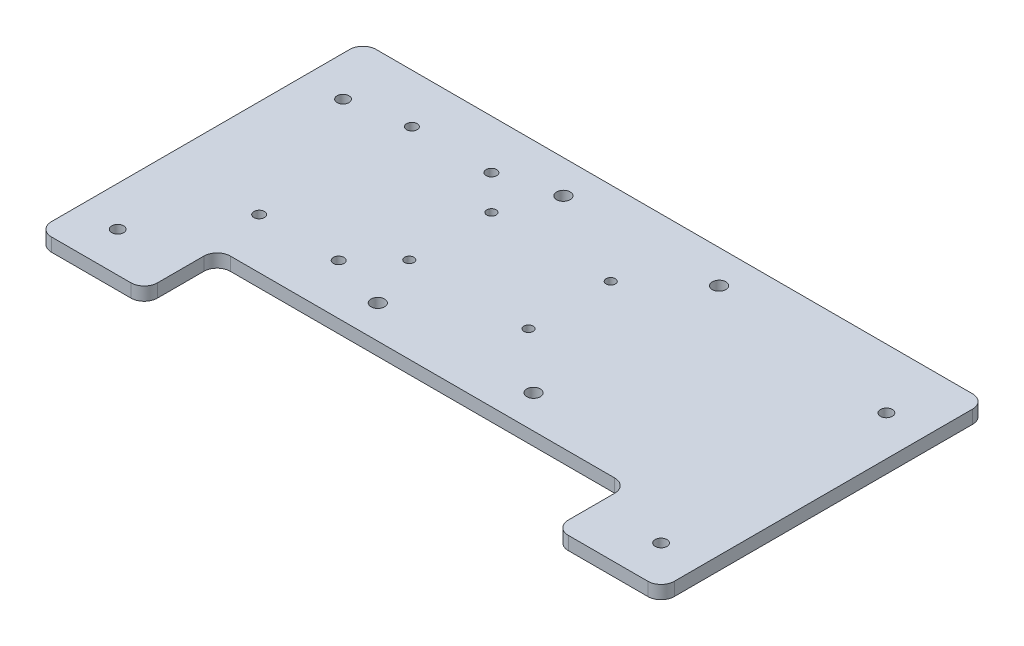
from build123d import *

# Parameters (mm, degrees)
ESQUISSE1_R             = 4.5
ESQUISSE1_R_2           = 3.5
BASE_EXTRUSION_DEPTH    = 10
ESQUISSE2_R             = 5.125
ENL_V_MAT_EXTRU_1_DEPTH = 340.632153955
ENL_V_MAT_EXTRU_2_REACH = 341.632
ESQUISSE3_R             = 4


with BuildPart() as part:
    # Esquisse1 → Base-Extrusion (new body)
    with BuildSketch(Plane(origin=(0, 0, 0), x_dir=(1, 0, 0), z_dir=(0, 1, 0))):
        with BuildLine():
            Line((165, 0), (225, 0))
            ThreePointArc((225, 0), (232.071067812, 2.928932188), (235, 10))
            Line((235, 10), (235, 235))
            ThreePointArc((235, 235), (232.071067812, 242.071067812), (225, 245))
            Line((225, 245), (-225, 245))
            ThreePointArc((-225, 245), (-232.071067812, 242.071067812), (-235, 235))
            Line((-235, 235), (-235, 10))
            ThreePointArc((-235, 10), (-232.071067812, 2.928932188), (-225, 0))
            Line((-225, 0), (-165, 0))
            ThreePointArc((-165, 0), (-157.928932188, 2.928932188), (-155, 10))
            Line((-155, 10), (-155, 45))
            ThreePointArc((-155, 45), (-152.071067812, 52.071067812), (-145, 55))
            Line((-145, 55), (145, 55))
            ThreePointArc((145, 55), (152.071067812, 52.071067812), (155, 45))
            Line((155, 45), (155, 10))
            ThreePointArc((155, 10), (157.928932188, 2.928932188), (165, 0))
        make_face()
        with Locations(Location((205, 200, 0), (0, 0, 270))):
            Circle(ESQUISSE1_R, mode=Mode.SUBTRACT)
        with Locations(Location((205, 30, 0), (0, 0, 270))):
            Circle(ESQUISSE1_R, mode=Mode.SUBTRACT)
        with Locations(Location((-205, 30, 0), (0, 0, 90))):
            Circle(ESQUISSE1_R, mode=Mode.SUBTRACT)
        with Locations(Location((-205, 200, 0), (0, 0, 90))):
            Circle(ESQUISSE1_R, mode=Mode.SUBTRACT)
        with Locations(Location((-75, 182, 0), (0, 0, 270))):
            Circle(ESQUISSE1_R_2, mode=Mode.SUBTRACT)
        with Locations(Location((-75, 120, 0), (0, 0, 270))):
            Circle(ESQUISSE1_R_2, mode=Mode.SUBTRACT)
        with Locations(Location((15, 182, 0), (0, 0, 270))):
            Circle(ESQUISSE1_R_2, mode=Mode.SUBTRACT)
        with Locations(Location((15, 120, 0), (0, 0, 270))):
            Circle(ESQUISSE1_R_2, mode=Mode.SUBTRACT)
    extrude(amount=BASE_EXTRUSION_DEPTH)

    # Esquisse2 → Enl_v. mat.-Extru.1 (cut, through all)
    with BuildSketch(Plane(origin=(0, 10, 0), x_dir=(-1, 0, 0), z_dir=(0, 1, 0))):
        with Locations(Location((58.75, -80, 0), (0, 0, 90))):
            Circle(ESQUISSE2_R)
        with Locations(Location((-58.75, -80, 0), (0, 0, 90))):
            Circle(ESQUISSE2_R)
        with Locations(Location((58.75, -220, 0), (0, 0, 90))):
            Circle(ESQUISSE2_R)
        with Locations(Location((-58.75, -220, 0), (0, 0, 90))):
            Circle(ESQUISSE2_R)
    extrude(amount=-ENL_V_MAT_EXTRU_1_DEPTH, mode=Mode.SUBTRACT)

    # Esquisse3 → Enl_v. mat.-Extru.2 (cut, up to next)
    with BuildSketch(Plane(origin=(0, 10, 0), x_dir=(-1, 0, 0), z_dir=(0, 1, 0)), mode=Mode.PRIVATE) as enl_v_mat_extru_2_sk1:
        with Locations(Location((101.05, -208, 0), (0, 0, 90))):
            Circle(ESQUISSE3_R)
    enl_v_mat_extru_2_tool1 = extrude(enl_v_mat_extru_2_sk1.sketch, amount=-ENL_V_MAT_EXTRU_2_REACH, mode=Mode.PRIVATE) & part.part
    # Esquisse3 → Enl_v. mat.-Extru.2 (cut, up to next)
    with BuildSketch(Plane(origin=(0, 10, 0), x_dir=(-1, 0, 0), z_dir=(0, 1, 0)), mode=Mode.PRIVATE) as enl_v_mat_extru_2_sk2:
        with Locations(Location((101.278392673, -93.000226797, 0), (0, 0, 90))):
            Circle(ESQUISSE3_R)
    enl_v_mat_extru_2_tool2 = extrude(enl_v_mat_extru_2_sk2.sketch, amount=-ENL_V_MAT_EXTRU_2_REACH, mode=Mode.PRIVATE) & part.part
    # Esquisse3 → Enl_v. mat.-Extru.2 (cut, up to next)
    with BuildSketch(Plane(origin=(0, 10, 0), x_dir=(-1, 0, 0), z_dir=(0, 1, 0)), mode=Mode.PRIVATE) as enl_v_mat_extru_2_sk3:
        with Locations(Location((161.278392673, -93.000226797, 0), (0, 0, 90))):
            Circle(ESQUISSE3_R)
    enl_v_mat_extru_2_tool3 = extrude(enl_v_mat_extru_2_sk3.sketch, amount=-ENL_V_MAT_EXTRU_2_REACH, mode=Mode.PRIVATE) & part.part
    # Esquisse3 → Enl_v. mat.-Extru.2 (cut, up to next)
    with BuildSketch(Plane(origin=(0, 10, 0), x_dir=(-1, 0, 0), z_dir=(0, 1, 0)), mode=Mode.PRIVATE) as enl_v_mat_extru_2_sk4:
        with Locations(Location((161.05, -208, 0), (0, 0, 90))):
            Circle(ESQUISSE3_R)
    enl_v_mat_extru_2_tool4 = extrude(enl_v_mat_extru_2_sk4.sketch, amount=-ENL_V_MAT_EXTRU_2_REACH, mode=Mode.PRIVATE) & part.part
    add(enl_v_mat_extru_2_tool1.solids().sort_by_distance((-101.05, 10, -208))[0], mode=Mode.SUBTRACT)
    add(enl_v_mat_extru_2_tool2.solids().sort_by_distance((-101.278393, 10, -93.000227))[0], mode=Mode.SUBTRACT)
    add(enl_v_mat_extru_2_tool3.solids().sort_by_distance((-161.278393, 10, -93.000227))[0], mode=Mode.SUBTRACT)
    add(enl_v_mat_extru_2_tool4.solids().sort_by_distance((-161.05, 10, -208))[0], mode=Mode.SUBTRACT)


solid = part.part
